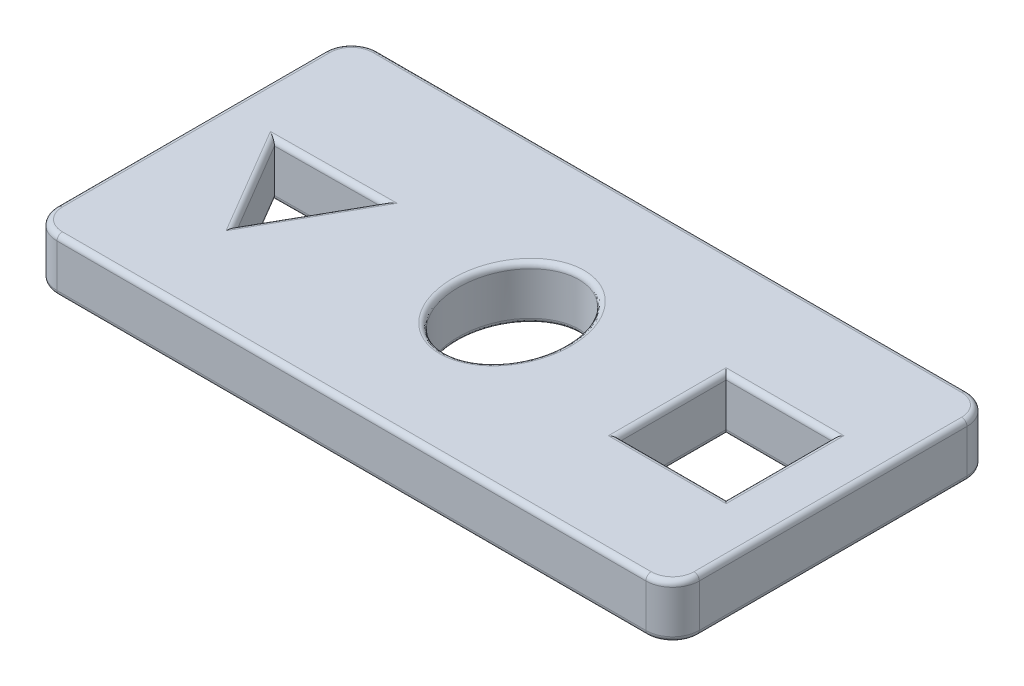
from build123d import *

# Parameters (mm, degrees)
ESQUISSE1_W             = 120
ESQUISSE1_H             = 60
BOSS_EXTRU_1_DEPTH      = 10
ESQUISSE2_RX            = 12.5
ESQUISSE2_RY            = 10
ESQUISSE2_W             = 20
ESQUISSE2_H             = 20
ENL_V_MAT_EXTRU_1_DEPTH = 68.823299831
CONG_1_R                = 5
CONG_2_R                = 1


with BuildPart() as part:
    # Esquisse1 → Boss.-Extru.1 (new body)
    with BuildSketch(Plane(origin=(0, 0, 0), x_dir=(1, 0, 0), z_dir=(0, 1, 0))):
        Rectangle(ESQUISSE1_W, ESQUISSE1_H)
    extrude(amount=BOSS_EXTRU_1_DEPTH)

    # Esquisse2 → Enl_v. mat.-Extru.1 (cut, through all)
    with BuildSketch(Plane(origin=(0, 10, 0), x_dir=(1, 0, 0), z_dir=(0, 1, 0))):
        with Locations(Location((0, 0), (0, 0, -90))):
            Ellipse(ESQUISSE2_RX, ESQUISSE2_RY)
        Polygon((-30.0533782, 5.865956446), (-50.0533782, 5.681048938), (-39.8932436, -11.547005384), align=None)
        with Locations((40, 0)):
            Rectangle(ESQUISSE2_W, ESQUISSE2_H)
    extrude(amount=-ENL_V_MAT_EXTRU_1_DEPTH, mode=Mode.SUBTRACT)

    # Cong_1
    cong_1_edges = [part.edges().sort_by_distance(p)[0] for p in [
        (60, 5, 30),
        (-60, 5, 30),
        (-60, 5, -30),
        (60, 5, -30),
    ]]
    fillet(cong_1_edges, radius=CONG_1_R)

    # Cong_2
    cong_2_edges = [part.edges().sort_by_distance(p)[0] for p in [
        (-34.9733109, 0, 2.840524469),
        (-44.9733109, 0, 2.932978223),
        (-40.0533782, 0, -5.773502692),
        (-34.9733109, 10, 2.840524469),
        (-40.0533782, 10, -5.773502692),
        (-44.9733109, 10, 2.932978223),
        (50, 0, 0),
        (40, 0, 10),
        (30, 0, 0),
        (40, 0, -10),
        (50, 10, 0),
        (40, 10, -10),
        (30, 10, 0),
        (40, 10, 10),
        (-3e-09, 0, -12.500000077),
        (-0.001564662, 10, -12.499999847),
        (0, 0, 30),
        (0, 10, 30),
        (60, 0, 0),
        (-60, 0, 0),
        (0, 0, -30),
        (-58.535533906, 0, -28.535533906),
        (58.535533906, 0, -28.535533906),
        (58.535533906, 0, 28.535533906),
        (-58.535533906, 0, 28.535533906),
        (-60, 10, 0),
        (60, 10, 0),
        (0, 10, -30),
        (-58.535533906, 10, -28.535533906),
        (58.535533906, 10, -28.535533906),
        (58.535533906, 10, 28.535533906),
        (-58.535533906, 10, 28.535533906),
    ]]
    fillet(cong_2_edges, radius=CONG_2_R)


solid = part.part
